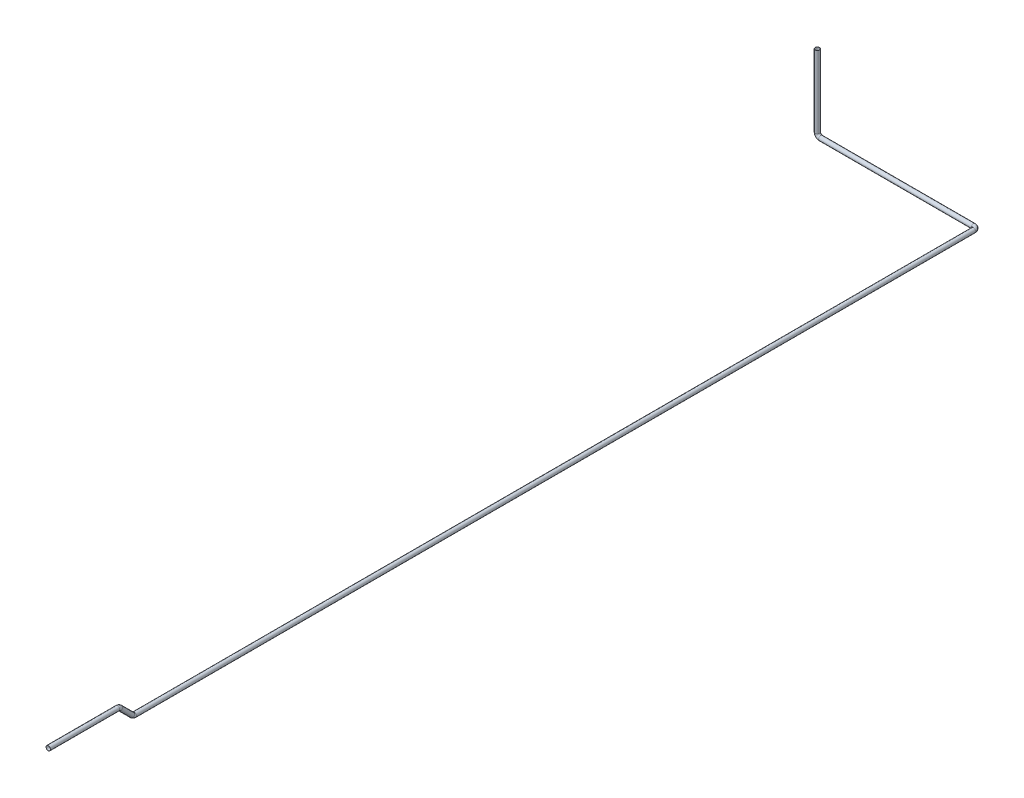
from build123d import *

# Parameters (mm, degrees)
CROQUIS2_R   = 31.75
CROQUIS2_R_2 = 30


with BuildPart() as part:
    # Barrer1: sweep along a curve in space
    with BuildLine() as barrer1_path:
        Line((0, 0, 0), (0, -1030, 0))
        ThreePointArc((0, -1030, 0), (14.644660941, -1065.355339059, 0), (50, -1080, 0))
        Line((50, -1080, 0), (2230, -1080, 0))
        ThreePointArc((2230, -1080, 0), (2265.355339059, -1080, 14.644660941), (2280, -1080, 50))
        Line((2280, -1080, 50), (2280, -1080, 12039.289321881))
        ThreePointArc((2280, -1080, 12039.289321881), (2280, -1076.193976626, 12058.4234935), (2280, -1065.355339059, 12074.644660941))
        Line((2280, -1065.355339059, 12074.644660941), (2280, -894.644660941, 12245.355339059))
        ThreePointArc((2280, -894.644660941, 12245.355339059), (2280, -883.806023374, 12261.5765065), (2280, -880, 12280.710678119))
        Line((2280, -880, 12280.710678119), (2280, -880, 13270))
    # Croquis2 → Barrer1 (sweep)
    with BuildSketch(Plane(origin=(0, 0, 0), x_dir=(1, 0, 0), z_dir=(0, 1, 0))):
        Circle(CROQUIS2_R)
        Circle(CROQUIS2_R_2, mode=Mode.SUBTRACT)
    sweep(path=barrer1_path.line)


solid = part.part
